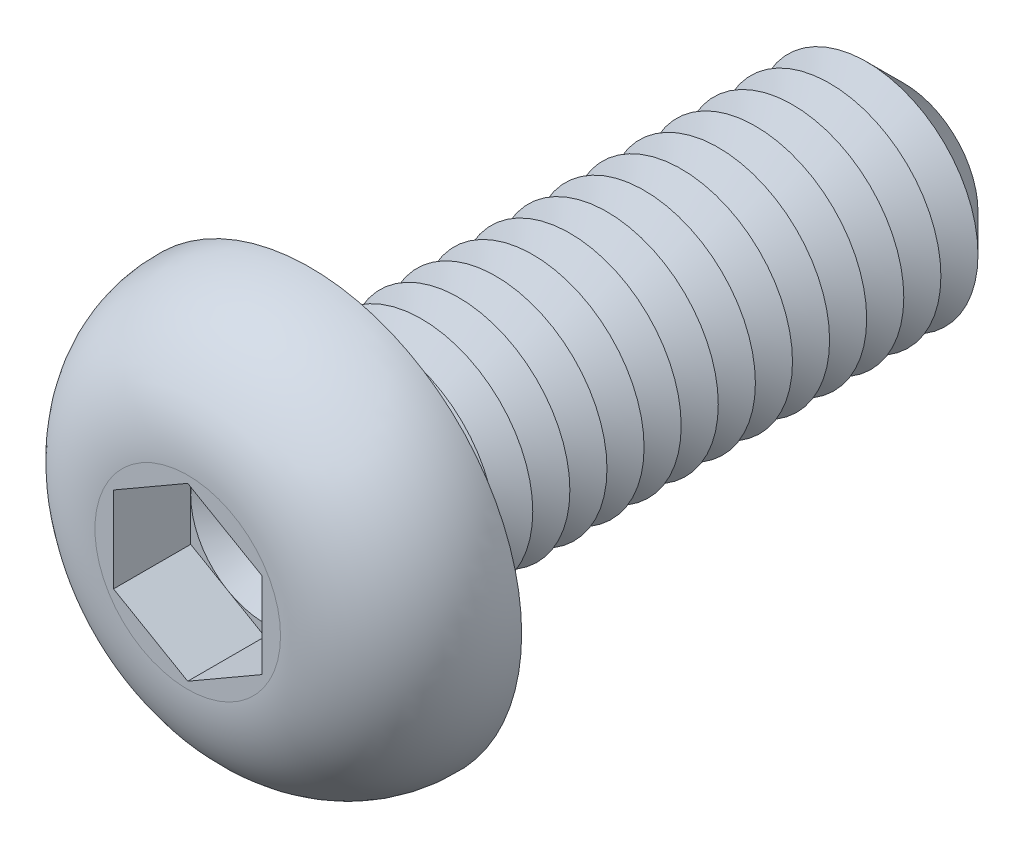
ISO-10303-21;
HEADER;
FILE_DESCRIPTION(('STEP AP214'),'2;1');
FILE_NAME('part.step','',(''),(''),'','','');
FILE_SCHEMA(('AUTOMOTIVE_DESIGN { 1 0 10303 214 1 1 1 1 }'));
ENDSEC;
DATA;
#1=APPLICATION_CONTEXT('core data for automotive mechanical design processes');
#2=APPLICATION_PROTOCOL_DEFINITION('international standard','automotive_design',2000,#1);
#3=PRODUCT_CONTEXT('',#1,'mechanical');
#4=PRODUCT('Part','Part','',(#3));
#5=PRODUCT_RELATED_PRODUCT_CATEGORY('part','',(#4));
#6=PRODUCT_DEFINITION_FORMATION('','',#4);
#7=PRODUCT_DEFINITION_CONTEXT('part definition',#1,'design');
#8=PRODUCT_DEFINITION('design','',#6,#7);
#9=PRODUCT_DEFINITION_SHAPE('','',#8);
#10=(LENGTH_UNIT() NAMED_UNIT(*) SI_UNIT(.MILLI.,.METRE.));
#11=(NAMED_UNIT(*) PLANE_ANGLE_UNIT() SI_UNIT($,.RADIAN.));
#12=(NAMED_UNIT(*) SI_UNIT($,.STERADIAN.) SOLID_ANGLE_UNIT());
#13=UNCERTAINTY_MEASURE_WITH_UNIT(LENGTH_MEASURE(1.E-05),#10,'distance_accuracy_value','');
#14=(GEOMETRIC_REPRESENTATION_CONTEXT(3) GLOBAL_UNCERTAINTY_ASSIGNED_CONTEXT((#13)) GLOBAL_UNIT_ASSIGNED_CONTEXT((#10,
#11,#12)) REPRESENTATION_CONTEXT('',''));
#15=CARTESIAN_POINT('',(0.,0.,0.));
#16=DIRECTION('',(0.,0.,1.));
#17=DIRECTION('',(1.,0.,0.));
#18=AXIS2_PLACEMENT_3D('',#15,#16,#17);
#19=CARTESIAN_POINT('',(0.,0.,0.61));
#20=DIRECTION('',(0.,0.,1.));
#21=DIRECTION('',(1.,0.,0.));
#22=AXIS2_PLACEMENT_3D('',#19,#20,#21);
#23=PLANE('',#22);
#24=CARTESIAN_POINT('',(0.,0.,0.61));
#25=DIRECTION('',(0.,0.,1.));
#26=DIRECTION('',(1.,0.,0.));
#27=AXIS2_PLACEMENT_3D('',#24,#25,#26);
#28=CIRCLE('',#27,1.);
#29=CARTESIAN_POINT('',(1.,0.,0.61));
#30=VERTEX_POINT('',#29);
#31=CARTESIAN_POINT('',(0.5,0.866025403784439,0.61));
#32=VERTEX_POINT('',#31);
#33=EDGE_CURVE('E111',#30,#32,#28,.T.);
#34=ORIENTED_EDGE('',*,*,#33,.F.);
#35=DIRECTION('',(0.,1.,0.));
#36=VECTOR('',#35,1.);
#37=CARTESIAN_POINT('',(1.,-0.577350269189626,0.61));
#38=LINE('',#37,#36);
#39=CARTESIAN_POINT('',(1.,0.577350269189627,0.61));
#40=VERTEX_POINT('',#39);
#41=EDGE_CURVE('E132',#30,#40,#38,.T.);
#42=ORIENTED_EDGE('',*,*,#41,.T.);
#43=DIRECTION('',(-0.866025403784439,0.5,0.));
#44=VECTOR('',#43,1.);
#45=CARTESIAN_POINT('',(1.,0.577350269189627,0.61));
#46=LINE('',#45,#44);
#47=EDGE_CURVE('E128',#40,#32,#46,.T.);
#48=ORIENTED_EDGE('',*,*,#47,.T.);
#49=EDGE_LOOP('',(#34,#42,#48));
#50=FACE_BOUND('',#49,.T.);
#51=ADVANCED_FACE('F34',(#50),#23,.T.);
#52=CARTESIAN_POINT('',(0.,0.,0.61));
#53=DIRECTION('',(0.,0.,1.));
#54=DIRECTION('',(1.,0.,0.));
#55=AXIS2_PLACEMENT_3D('',#52,#53,#54);
#56=CIRCLE('',#55,1.);
#57=CARTESIAN_POINT('',(-0.5,0.866025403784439,0.61));
#58=VERTEX_POINT('',#57);
#59=EDGE_CURVE('E11',#32,#58,#56,.T.);
#60=ORIENTED_EDGE('',*,*,#59,.F.);
#61=CARTESIAN_POINT('',(0.,1.15470053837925,0.61));
#62=VERTEX_POINT('',#61);
#63=EDGE_CURVE('E123',#32,#62,#46,.T.);
#64=ORIENTED_EDGE('',*,*,#63,.T.);
#65=DIRECTION('',(-0.866025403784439,-0.5,0.));
#66=VECTOR('',#65,1.);
#67=CARTESIAN_POINT('',(0.,1.15470053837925,0.61));
#68=LINE('',#67,#66);
#69=EDGE_CURVE('E125',#62,#58,#68,.T.);
#70=ORIENTED_EDGE('',*,*,#69,.T.);
#71=EDGE_LOOP('',(#60,#64,#70));
#72=FACE_BOUND('',#71,.T.);
#73=ADVANCED_FACE('F122',(#72),#23,.T.);
#74=CARTESIAN_POINT('',(-1.,0.,0.61));
#75=VERTEX_POINT('',#74);
#76=EDGE_CURVE('E43',#58,#75,#56,.T.);
#77=ORIENTED_EDGE('',*,*,#76,.F.);
#78=CARTESIAN_POINT('',(-1.,0.577350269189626,0.61));
#79=VERTEX_POINT('',#78);
#80=EDGE_CURVE('E134',#58,#79,#68,.T.);
#81=ORIENTED_EDGE('',*,*,#80,.T.);
#82=DIRECTION('',(0.,-1.,0.));
#83=VECTOR('',#82,1.);
#84=CARTESIAN_POINT('',(-1.,0.577350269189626,0.61));
#85=LINE('',#84,#83);
#86=EDGE_CURVE('E141',#79,#75,#85,.T.);
#87=ORIENTED_EDGE('',*,*,#86,.T.);
#88=EDGE_LOOP('',(#77,#81,#87));
#89=FACE_BOUND('',#88,.T.);
#90=ADVANCED_FACE('F208',(#89),#23,.T.);
#91=CARTESIAN_POINT('',(-0.5,-0.866025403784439,0.61));
#92=VERTEX_POINT('',#91);
#93=EDGE_CURVE('E196',#75,#92,#56,.T.);
#94=ORIENTED_EDGE('',*,*,#93,.F.);
#95=CARTESIAN_POINT('',(-1.,-0.577350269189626,0.61));
#96=VERTEX_POINT('',#95);
#97=EDGE_CURVE('E140',#75,#96,#85,.T.);
#98=ORIENTED_EDGE('',*,*,#97,.T.);
#99=DIRECTION('',(0.866025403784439,-0.5,0.));
#100=VECTOR('',#99,1.);
#101=CARTESIAN_POINT('',(-1.,-0.577350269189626,0.61));
#102=LINE('',#101,#100);
#103=EDGE_CURVE('E145',#96,#92,#102,.T.);
#104=ORIENTED_EDGE('',*,*,#103,.T.);
#105=EDGE_LOOP('',(#94,#98,#104));
#106=FACE_BOUND('',#105,.T.);
#107=ADVANCED_FACE('F202',(#106),#23,.T.);
#108=CARTESIAN_POINT('',(0.5,-0.866025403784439,0.61));
#109=VERTEX_POINT('',#108);
#110=EDGE_CURVE('E50',#92,#109,#56,.T.);
#111=ORIENTED_EDGE('',*,*,#110,.F.);
#112=CARTESIAN_POINT('',(0.,-1.15470053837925,0.61));
#113=VERTEX_POINT('',#112);
#114=EDGE_CURVE('E144',#92,#113,#102,.T.);
#115=ORIENTED_EDGE('',*,*,#114,.T.);
#116=DIRECTION('',(0.866025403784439,0.5,0.));
#117=VECTOR('',#116,1.);
#118=CARTESIAN_POINT('',(0.,-1.15470053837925,0.61));
#119=LINE('',#118,#117);
#120=EDGE_CURVE('E149',#113,#109,#119,.T.);
#121=ORIENTED_EDGE('',*,*,#120,.T.);
#122=EDGE_LOOP('',(#111,#115,#121));
#123=FACE_BOUND('',#122,.T.);
#124=ADVANCED_FACE('F226',(#123),#23,.T.);
#125=CARTESIAN_POINT('',(0.,0.,-8.));
#126=DIRECTION('',(0.,0.,1.));
#127=DIRECTION('',(1.,0.,0.));
#128=AXIS2_PLACEMENT_3D('',#125,#126,#127);
#129=CYLINDRICAL_SURFACE('',#128,1.5);
#130=CARTESIAN_POINT('',(0.,0.,-0.2));
#131=DIRECTION('',(0.,0.,1.));
#132=DIRECTION('',(1.,0.,0.));
#133=AXIS2_PLACEMENT_3D('',#130,#131,#132);
#134=CIRCLE('',#133,1.5);
#135=CARTESIAN_POINT('',(1.5,0.,-0.2));
#136=VERTEX_POINT('',#135);
#137=EDGE_CURVE('E190',#136,#136,#134,.F.);
#138=ORIENTED_EDGE('',*,*,#137,.T.);
#139=EDGE_LOOP('',(#138));
#140=FACE_BOUND('',#139,.T.);
#141=CARTESIAN_POINT('',(0.,0.,-0.5));
#142=DIRECTION('',(0.,0.,1.));
#143=DIRECTION('',(1.,0.,0.));
#144=AXIS2_PLACEMENT_3D('',#141,#142,#143);
#145=CIRCLE('',#144,1.50000000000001);
#146=CARTESIAN_POINT('',(1.50000000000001,0.,-0.5));
#147=VERTEX_POINT('',#146);
#148=EDGE_CURVE('E137',#147,#147,#145,.T.);
#149=ORIENTED_EDGE('',*,*,#148,.T.);
#150=EDGE_LOOP('',(#149));
#151=FACE_BOUND('',#150,.T.);
#152=ADVANCED_FACE('F262',(#140,#151),#129,.T.);
#153=CARTESIAN_POINT('',(0.,2.85,0.));
#154=DIRECTION('',(0.,0.,1.));
#155=DIRECTION('',(1.,0.,0.));
#156=AXIS2_PLACEMENT_3D('',#153,#154,#155);
#157=PLANE('',#156);
#158=CARTESIAN_POINT('',(0.,0.,0.));
#159=DIRECTION('',(0.,0.,1.));
#160=DIRECTION('',(1.,0.,0.));
#161=AXIS2_PLACEMENT_3D('',#158,#159,#160);
#162=CIRCLE('',#161,1.7);
#163=CARTESIAN_POINT('',(1.7,0.,0.));
#164=VERTEX_POINT('',#163);
#165=EDGE_CURVE('E192',#164,#164,#162,.T.);
#166=ORIENTED_EDGE('',*,*,#165,.T.);
#167=EDGE_LOOP('',(#166));
#168=FACE_BOUND('',#167,.T.);
#169=CARTESIAN_POINT('',(0.,0.,0.));
#170=DIRECTION('',(0.,0.,1.));
#171=DIRECTION('',(1.,0.,0.));
#172=AXIS2_PLACEMENT_3D('',#169,#170,#171);
#173=CIRCLE('',#172,2.85);
#174=CARTESIAN_POINT('',(2.85,0.,0.));
#175=VERTEX_POINT('',#174);
#176=EDGE_CURVE('E172',#175,#175,#173,.T.);
#177=ORIENTED_EDGE('',*,*,#176,.F.);
#178=EDGE_LOOP('',(#177));
#179=FACE_BOUND('',#178,.T.);
#180=ADVANCED_FACE('F267',(#168,#179),#157,.F.);
#181=CARTESIAN_POINT('',(0.,0.,1.65));
#182=DIRECTION('',(0.,0.,-1.));
#183=DIRECTION('',(-1.,0.,0.));
#184=AXIS2_PLACEMENT_3D('',#181,#182,#183);
#185=PLANE('',#184);
#186=DIRECTION('',(-0.866025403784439,-0.5,0.));
#187=VECTOR('',#186,1.);
#188=CARTESIAN_POINT('',(0.,1.15470053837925,1.65));
#189=LINE('',#188,#187);
#190=CARTESIAN_POINT('',(0.,1.15470053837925,1.65));
#191=VERTEX_POINT('',#190);
#192=CARTESIAN_POINT('',(-1.,0.577350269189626,1.65));
#193=VERTEX_POINT('',#192);
#194=EDGE_CURVE('E156',#191,#193,#189,.T.);
#195=ORIENTED_EDGE('',*,*,#194,.F.);
#196=DIRECTION('',(-0.866025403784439,0.5,0.));
#197=VECTOR('',#196,1.);
#198=CARTESIAN_POINT('',(1.,0.577350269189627,1.65));
#199=LINE('',#198,#197);
#200=CARTESIAN_POINT('',(1.,0.577350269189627,1.65));
#201=VERTEX_POINT('',#200);
#202=EDGE_CURVE('E58',#201,#191,#199,.T.);
#203=ORIENTED_EDGE('',*,*,#202,.F.);
#204=DIRECTION('',(0.,1.,0.));
#205=VECTOR('',#204,1.);
#206=CARTESIAN_POINT('',(1.,-0.577350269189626,1.65));
#207=LINE('',#206,#205);
#208=CARTESIAN_POINT('',(1.,-0.577350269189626,1.65));
#209=VERTEX_POINT('',#208);
#210=EDGE_CURVE('E130',#209,#201,#207,.T.);
#211=ORIENTED_EDGE('',*,*,#210,.F.);
#212=DIRECTION('',(0.866025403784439,0.5,0.));
#213=VECTOR('',#212,1.);
#214=CARTESIAN_POINT('',(0.,-1.15470053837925,1.65));
#215=LINE('',#214,#213);
#216=CARTESIAN_POINT('',(0.,-1.15470053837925,1.65));
#217=VERTEX_POINT('',#216);
#218=EDGE_CURVE('E165',#217,#209,#215,.T.);
#219=ORIENTED_EDGE('',*,*,#218,.F.);
#220=DIRECTION('',(0.866025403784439,-0.5,0.));
#221=VECTOR('',#220,1.);
#222=CARTESIAN_POINT('',(-1.,-0.577350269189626,1.65));
#223=LINE('',#222,#221);
#224=CARTESIAN_POINT('',(-1.,-0.577350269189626,1.65));
#225=VERTEX_POINT('',#224);
#226=EDGE_CURVE('E162',#225,#217,#223,.T.);
#227=ORIENTED_EDGE('',*,*,#226,.F.);
#228=DIRECTION('',(0.,-1.,0.));
#229=VECTOR('',#228,1.);
#230=CARTESIAN_POINT('',(-1.,0.577350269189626,1.65));
#231=LINE('',#230,#229);
#232=EDGE_CURVE('E159',#193,#225,#231,.T.);
#233=ORIENTED_EDGE('',*,*,#232,.F.);
#234=EDGE_LOOP('',(#195,#203,#211,#219,#227,#233));
#235=FACE_BOUND('',#234,.T.);
#236=CARTESIAN_POINT('',(0.,0.,1.65));
#237=DIRECTION('',(0.,0.,1.));
#238=DIRECTION('',(1.,0.,0.));
#239=AXIS2_PLACEMENT_3D('',#236,#237,#238);
#240=CIRCLE('',#239,1.25078144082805);
#241=CARTESIAN_POINT('',(1.25078144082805,0.,1.65));
#242=VERTEX_POINT('',#241);
#243=EDGE_CURVE('E184',#242,#242,#240,.T.);
#244=ORIENTED_EDGE('',*,*,#243,.T.);
#245=EDGE_LOOP('',(#244));
#246=FACE_BOUND('',#245,.T.);
#247=ADVANCED_FACE('F217',(#235,#246),#185,.F.);
#248=CARTESIAN_POINT('',(0.,0.,0.0499999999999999));
#249=DIRECTION('',(0.,0.,1.));
#250=DIRECTION('',(1.,0.,0.));
#251=AXIS2_PLACEMENT_3D('',#248,#249,#250);
#252=DEGENERATE_TOROIDAL_SURFACE('',#251,1.25078144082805,1.6,.T.);
#253=ORIENTED_EDGE('',*,*,#243,.F.);
#254=EDGE_LOOP('',(#253));
#255=FACE_BOUND('',#254,.T.);
#256=ORIENTED_EDGE('',*,*,#176,.T.);
#257=EDGE_LOOP('',(#256));
#258=FACE_BOUND('',#257,.T.);
#259=ADVANCED_FACE('F243',(#255,#258),#252,.T.);
#260=CARTESIAN_POINT('',(1.,0.577350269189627,0.61));
#261=DIRECTION('',(0.5,0.866025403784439,0.));
#262=DIRECTION('',(-0.866025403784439,0.5,0.));
#263=AXIS2_PLACEMENT_3D('',#260,#261,#262);
#264=PLANE('',#263);
#265=ORIENTED_EDGE('',*,*,#202,.T.);
#266=DIRECTION('',(0.,0.,1.));
#267=VECTOR('',#266,1.);
#268=CARTESIAN_POINT('',(0.,1.15470053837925,0.61));
#269=LINE('',#268,#267);
#270=EDGE_CURVE('E129',#62,#191,#269,.T.);
#271=ORIENTED_EDGE('',*,*,#270,.F.);
#272=ORIENTED_EDGE('',*,*,#63,.F.);
#273=ORIENTED_EDGE('',*,*,#47,.F.);
#274=DIRECTION('',(0.,0.,1.));
#275=VECTOR('',#274,1.);
#276=CARTESIAN_POINT('',(1.,0.577350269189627,0.61));
#277=LINE('',#276,#275);
#278=EDGE_CURVE('E170',#40,#201,#277,.T.);
#279=ORIENTED_EDGE('',*,*,#278,.T.);
#280=EDGE_LOOP('',(#265,#271,#272,#273,#279));
#281=FACE_BOUND('',#280,.T.);
#282=ADVANCED_FACE('F127',(#281),#264,.F.);
#283=CARTESIAN_POINT('',(1.,-0.577350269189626,0.61));
#284=DIRECTION('',(1.,0.,0.));
#285=DIRECTION('',(0.,0.,-1.));
#286=AXIS2_PLACEMENT_3D('',#283,#284,#285);
#287=PLANE('',#286);
#288=ORIENTED_EDGE('',*,*,#210,.T.);
#289=ORIENTED_EDGE('',*,*,#278,.F.);
#290=ORIENTED_EDGE('',*,*,#41,.F.);
#291=CARTESIAN_POINT('',(1.,-0.577350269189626,0.61));
#292=VERTEX_POINT('',#291);
#293=EDGE_CURVE('E152',#292,#30,#38,.T.);
#294=ORIENTED_EDGE('',*,*,#293,.F.);
#295=DIRECTION('',(0.,0.,1.));
#296=VECTOR('',#295,1.);
#297=CARTESIAN_POINT('',(1.,-0.577350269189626,0.61));
#298=LINE('',#297,#296);
#299=EDGE_CURVE('E173',#292,#209,#298,.T.);
#300=ORIENTED_EDGE('',*,*,#299,.T.);
#301=EDGE_LOOP('',(#288,#289,#290,#294,#300));
#302=FACE_BOUND('',#301,.T.);
#303=ADVANCED_FACE('F235',(#302),#287,.F.);
#304=CARTESIAN_POINT('',(0.,-1.15470053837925,0.61));
#305=DIRECTION('',(0.5,-0.866025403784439,0.));
#306=DIRECTION('',(0.866025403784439,0.5,0.));
#307=AXIS2_PLACEMENT_3D('',#304,#305,#306);
#308=PLANE('',#307);
#309=ORIENTED_EDGE('',*,*,#218,.T.);
#310=ORIENTED_EDGE('',*,*,#299,.F.);
#311=EDGE_CURVE('E148',#109,#292,#119,.T.);
#312=ORIENTED_EDGE('',*,*,#311,.F.);
#313=ORIENTED_EDGE('',*,*,#120,.F.);
#314=DIRECTION('',(0.,0.,1.));
#315=VECTOR('',#314,1.);
#316=CARTESIAN_POINT('',(0.,-1.15470053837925,0.61));
#317=LINE('',#316,#315);
#318=EDGE_CURVE('E175',#113,#217,#317,.T.);
#319=ORIENTED_EDGE('',*,*,#318,.T.);
#320=EDGE_LOOP('',(#309,#310,#312,#313,#319));
#321=FACE_BOUND('',#320,.T.);
#322=ADVANCED_FACE('F229',(#321),#308,.F.);
#323=CARTESIAN_POINT('',(-1.,-0.577350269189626,0.61));
#324=DIRECTION('',(-0.5,-0.866025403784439,0.));
#325=DIRECTION('',(0.866025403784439,-0.5,0.));
#326=AXIS2_PLACEMENT_3D('',#323,#324,#325);
#327=PLANE('',#326);
#328=ORIENTED_EDGE('',*,*,#226,.T.);
#329=ORIENTED_EDGE('',*,*,#318,.F.);
#330=ORIENTED_EDGE('',*,*,#114,.F.);
#331=ORIENTED_EDGE('',*,*,#103,.F.);
#332=DIRECTION('',(0.,0.,1.));
#333=VECTOR('',#332,1.);
#334=CARTESIAN_POINT('',(-1.,-0.577350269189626,0.61));
#335=LINE('',#334,#333);
#336=EDGE_CURVE('E177',#96,#225,#335,.T.);
#337=ORIENTED_EDGE('',*,*,#336,.T.);
#338=EDGE_LOOP('',(#328,#329,#330,#331,#337));
#339=FACE_BOUND('',#338,.T.);
#340=ADVANCED_FACE('F222',(#339),#327,.F.);
#341=CARTESIAN_POINT('',(-1.,0.577350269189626,0.61));
#342=DIRECTION('',(-1.,0.,0.));
#343=DIRECTION('',(0.,-1.,0.));
#344=AXIS2_PLACEMENT_3D('',#341,#342,#343);
#345=PLANE('',#344);
#346=ORIENTED_EDGE('',*,*,#232,.T.);
#347=ORIENTED_EDGE('',*,*,#336,.F.);
#348=ORIENTED_EDGE('',*,*,#97,.F.);
#349=ORIENTED_EDGE('',*,*,#86,.F.);
#350=DIRECTION('',(0.,0.,1.));
#351=VECTOR('',#350,1.);
#352=CARTESIAN_POINT('',(-1.,0.577350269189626,0.61));
#353=LINE('',#352,#351);
#354=EDGE_CURVE('E179',#79,#193,#353,.T.);
#355=ORIENTED_EDGE('',*,*,#354,.T.);
#356=EDGE_LOOP('',(#346,#347,#348,#349,#355));
#357=FACE_BOUND('',#356,.T.);
#358=ADVANCED_FACE('F207',(#357),#345,.F.);
#359=CARTESIAN_POINT('',(0.,1.15470053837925,0.61));
#360=DIRECTION('',(-0.5,0.866025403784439,0.));
#361=DIRECTION('',(-0.866025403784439,-0.5,0.));
#362=AXIS2_PLACEMENT_3D('',#359,#360,#361);
#363=PLANE('',#362);
#364=ORIENTED_EDGE('',*,*,#194,.T.);
#365=ORIENTED_EDGE('',*,*,#354,.F.);
#366=ORIENTED_EDGE('',*,*,#80,.F.);
#367=ORIENTED_EDGE('',*,*,#69,.F.);
#368=ORIENTED_EDGE('',*,*,#270,.T.);
#369=EDGE_LOOP('',(#364,#365,#366,#367,#368));
#370=FACE_BOUND('',#369,.T.);
#371=ADVANCED_FACE('F211',(#370),#363,.F.);
#372=EDGE_CURVE('E38',#109,#30,#56,.T.);
#373=ORIENTED_EDGE('',*,*,#372,.F.);
#374=ORIENTED_EDGE('',*,*,#311,.T.);
#375=ORIENTED_EDGE('',*,*,#293,.T.);
#376=EDGE_LOOP('',(#373,#374,#375));
#377=FACE_BOUND('',#376,.T.);
#378=ADVANCED_FACE('F233',(#377),#23,.T.);
#379=CARTESIAN_POINT('',(0.,0.,-0.5));
#380=DIRECTION('',(0.,0.,1.));
#381=DIRECTION('',(1.,0.,0.));
#382=AXIS2_PLACEMENT_3D('',#379,#380,#381);
#383=CONICAL_SURFACE('',#382,1.50000000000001,1.0471975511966);
#384=CARTESIAN_POINT('',(0.,0.,-0.750000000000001));
#385=DIRECTION('',(0.,0.,1.));
#386=DIRECTION('',(1.,0.,0.));
#387=AXIS2_PLACEMENT_3D('',#384,#385,#386);
#388=CIRCLE('',#387,1.06698729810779);
#389=CARTESIAN_POINT('',(1.06698729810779,0.,-0.750000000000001));
#390=VERTEX_POINT('',#389);
#391=EDGE_CURVE('E764',#390,#390,#388,.T.);
#392=ORIENTED_EDGE('',*,*,#391,.T.);
#393=EDGE_LOOP('',(#392));
#394=FACE_BOUND('',#393,.T.);
#395=ORIENTED_EDGE('',*,*,#148,.F.);
#396=EDGE_LOOP('',(#395));
#397=FACE_BOUND('',#396,.T.);
#398=ADVANCED_FACE('F252',(#394,#397),#383,.T.);
#399=CARTESIAN_POINT('',(0.,0.,-0.750000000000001));
#400=DIRECTION('',(0.,0.,-1.));
#401=DIRECTION('',(-1.,0.,0.));
#402=AXIS2_PLACEMENT_3D('',#399,#400,#401);
#403=CONICAL_SURFACE('',#402,1.06698729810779,1.0471975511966);
#404=CARTESIAN_POINT('',(0.,0.,-1.));
#405=DIRECTION('',(0.,0.,1.));
#406=DIRECTION('',(1.,0.,0.));
#407=AXIS2_PLACEMENT_3D('',#404,#405,#406);
#408=CIRCLE('',#407,1.50000000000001);
#409=CARTESIAN_POINT('',(1.50000000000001,0.,-1.));
#410=VERTEX_POINT('',#409);
#411=EDGE_CURVE('E762',#410,#410,#408,.T.);
#412=ORIENTED_EDGE('',*,*,#411,.T.);
#413=EDGE_LOOP('',(#412));
#414=FACE_BOUND('',#413,.T.);
#415=ORIENTED_EDGE('',*,*,#391,.F.);
#416=EDGE_LOOP('',(#415));
#417=FACE_BOUND('',#416,.T.);
#418=ADVANCED_FACE('F257',(#414,#417),#403,.T.);
#419=CARTESIAN_POINT('',(0.,0.,-1.));
#420=DIRECTION('',(0.,0.,1.));
#421=DIRECTION('',(1.,0.,0.));
#422=AXIS2_PLACEMENT_3D('',#419,#420,#421);
#423=CONICAL_SURFACE('',#422,1.50000000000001,1.0471975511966);
#424=CARTESIAN_POINT('',(0.,0.,-1.25));
#425=DIRECTION('',(0.,0.,1.));
#426=DIRECTION('',(1.,0.,0.));
#427=AXIS2_PLACEMENT_3D('',#424,#425,#426);
#428=CIRCLE('',#427,1.06698729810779);
#429=CARTESIAN_POINT('',(1.06698729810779,0.,-1.25));
#430=VERTEX_POINT('',#429);
#431=EDGE_CURVE('E759',#430,#430,#428,.T.);
#432=ORIENTED_EDGE('',*,*,#431,.T.);
#433=EDGE_LOOP('',(#432));
#434=FACE_BOUND('',#433,.T.);
#435=ORIENTED_EDGE('',*,*,#411,.F.);
#436=EDGE_LOOP('',(#435));
#437=FACE_BOUND('',#436,.T.);
#438=ADVANCED_FACE('F564',(#434,#437),#423,.T.);
#439=CARTESIAN_POINT('',(0.,0.,-1.25));
#440=DIRECTION('',(0.,0.,-1.));
#441=DIRECTION('',(-1.,0.,0.));
#442=AXIS2_PLACEMENT_3D('',#439,#440,#441);
#443=CONICAL_SURFACE('',#442,1.06698729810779,1.0471975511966);
#444=CARTESIAN_POINT('',(0.,0.,-1.5));
#445=DIRECTION('',(0.,0.,1.));
#446=DIRECTION('',(1.,0.,0.));
#447=AXIS2_PLACEMENT_3D('',#444,#445,#446);
#448=CIRCLE('',#447,1.50000000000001);
#449=CARTESIAN_POINT('',(1.50000000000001,0.,-1.5));
#450=VERTEX_POINT('',#449);
#451=EDGE_CURVE('E756',#450,#450,#448,.T.);
#452=ORIENTED_EDGE('',*,*,#451,.T.);
#453=EDGE_LOOP('',(#452));
#454=FACE_BOUND('',#453,.T.);
#455=ORIENTED_EDGE('',*,*,#431,.F.);
#456=EDGE_LOOP('',(#455));
#457=FACE_BOUND('',#456,.T.);
#458=ADVANCED_FACE('F554',(#454,#457),#443,.T.);
#459=CARTESIAN_POINT('',(0.,0.,-1.5));
#460=DIRECTION('',(0.,0.,1.));
#461=DIRECTION('',(1.,0.,0.));
#462=AXIS2_PLACEMENT_3D('',#459,#460,#461);
#463=CONICAL_SURFACE('',#462,1.50000000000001,1.0471975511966);
#464=CARTESIAN_POINT('',(0.,0.,-1.75));
#465=DIRECTION('',(0.,0.,1.));
#466=DIRECTION('',(1.,0.,0.));
#467=AXIS2_PLACEMENT_3D('',#464,#465,#466);
#468=CIRCLE('',#467,1.06698729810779);
#469=CARTESIAN_POINT('',(1.06698729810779,0.,-1.75));
#470=VERTEX_POINT('',#469);
#471=EDGE_CURVE('E753',#470,#470,#468,.T.);
#472=ORIENTED_EDGE('',*,*,#471,.T.);
#473=EDGE_LOOP('',(#472));
#474=FACE_BOUND('',#473,.T.);
#475=ORIENTED_EDGE('',*,*,#451,.F.);
#476=EDGE_LOOP('',(#475));
#477=FACE_BOUND('',#476,.T.);
#478=ADVANCED_FACE('F544',(#474,#477),#463,.T.);
#479=CARTESIAN_POINT('',(0.,0.,-1.75));
#480=DIRECTION('',(0.,0.,-1.));
#481=DIRECTION('',(-1.,0.,0.));
#482=AXIS2_PLACEMENT_3D('',#479,#480,#481);
#483=CONICAL_SURFACE('',#482,1.06698729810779,1.0471975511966);
#484=CARTESIAN_POINT('',(0.,0.,-2.));
#485=DIRECTION('',(0.,0.,1.));
#486=DIRECTION('',(1.,0.,0.));
#487=AXIS2_PLACEMENT_3D('',#484,#485,#486);
#488=CIRCLE('',#487,1.50000000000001);
#489=CARTESIAN_POINT('',(1.50000000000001,0.,-2.));
#490=VERTEX_POINT('',#489);
#491=EDGE_CURVE('E750',#490,#490,#488,.T.);
#492=ORIENTED_EDGE('',*,*,#491,.T.);
#493=EDGE_LOOP('',(#492));
#494=FACE_BOUND('',#493,.T.);
#495=ORIENTED_EDGE('',*,*,#471,.F.);
#496=EDGE_LOOP('',(#495));
#497=FACE_BOUND('',#496,.T.);
#498=ADVANCED_FACE('F534',(#494,#497),#483,.T.);
#499=CARTESIAN_POINT('',(0.,0.,-2.));
#500=DIRECTION('',(0.,0.,1.));
#501=DIRECTION('',(1.,0.,0.));
#502=AXIS2_PLACEMENT_3D('',#499,#500,#501);
#503=CONICAL_SURFACE('',#502,1.50000000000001,1.0471975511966);
#504=CARTESIAN_POINT('',(0.,0.,-2.25));
#505=DIRECTION('',(0.,0.,1.));
#506=DIRECTION('',(1.,0.,0.));
#507=AXIS2_PLACEMENT_3D('',#504,#505,#506);
#508=CIRCLE('',#507,1.06698729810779);
#509=CARTESIAN_POINT('',(1.06698729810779,0.,-2.25));
#510=VERTEX_POINT('',#509);
#511=EDGE_CURVE('E747',#510,#510,#508,.T.);
#512=ORIENTED_EDGE('',*,*,#511,.T.);
#513=EDGE_LOOP('',(#512));
#514=FACE_BOUND('',#513,.T.);
#515=ORIENTED_EDGE('',*,*,#491,.F.);
#516=EDGE_LOOP('',(#515));
#517=FACE_BOUND('',#516,.T.);
#518=ADVANCED_FACE('F524',(#514,#517),#503,.T.);
#519=CARTESIAN_POINT('',(0.,0.,-2.25));
#520=DIRECTION('',(0.,0.,-1.));
#521=DIRECTION('',(-1.,0.,0.));
#522=AXIS2_PLACEMENT_3D('',#519,#520,#521);
#523=CONICAL_SURFACE('',#522,1.06698729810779,1.0471975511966);
#524=CARTESIAN_POINT('',(0.,0.,-2.5));
#525=DIRECTION('',(0.,0.,1.));
#526=DIRECTION('',(1.,0.,0.));
#527=AXIS2_PLACEMENT_3D('',#524,#525,#526);
#528=CIRCLE('',#527,1.50000000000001);
#529=CARTESIAN_POINT('',(1.50000000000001,0.,-2.5));
#530=VERTEX_POINT('',#529);
#531=EDGE_CURVE('E744',#530,#530,#528,.T.);
#532=ORIENTED_EDGE('',*,*,#531,.T.);
#533=EDGE_LOOP('',(#532));
#534=FACE_BOUND('',#533,.T.);
#535=ORIENTED_EDGE('',*,*,#511,.F.);
#536=EDGE_LOOP('',(#535));
#537=FACE_BOUND('',#536,.T.);
#538=ADVANCED_FACE('F514',(#534,#537),#523,.T.);
#539=CARTESIAN_POINT('',(0.,0.,-2.5));
#540=DIRECTION('',(0.,0.,1.));
#541=DIRECTION('',(1.,0.,0.));
#542=AXIS2_PLACEMENT_3D('',#539,#540,#541);
#543=CONICAL_SURFACE('',#542,1.50000000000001,1.0471975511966);
#544=CARTESIAN_POINT('',(0.,0.,-2.75));
#545=DIRECTION('',(0.,0.,1.));
#546=DIRECTION('',(1.,0.,0.));
#547=AXIS2_PLACEMENT_3D('',#544,#545,#546);
#548=CIRCLE('',#547,1.06698729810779);
#549=CARTESIAN_POINT('',(1.06698729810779,0.,-2.75));
#550=VERTEX_POINT('',#549);
#551=EDGE_CURVE('E741',#550,#550,#548,.T.);
#552=ORIENTED_EDGE('',*,*,#551,.T.);
#553=EDGE_LOOP('',(#552));
#554=FACE_BOUND('',#553,.T.);
#555=ORIENTED_EDGE('',*,*,#531,.F.);
#556=EDGE_LOOP('',(#555));
#557=FACE_BOUND('',#556,.T.);
#558=ADVANCED_FACE('F504',(#554,#557),#543,.T.);
#559=CARTESIAN_POINT('',(0.,0.,-2.75));
#560=DIRECTION('',(0.,0.,-1.));
#561=DIRECTION('',(-1.,0.,0.));
#562=AXIS2_PLACEMENT_3D('',#559,#560,#561);
#563=CONICAL_SURFACE('',#562,1.06698729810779,1.0471975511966);
#564=CARTESIAN_POINT('',(0.,0.,-3.));
#565=DIRECTION('',(0.,0.,1.));
#566=DIRECTION('',(1.,0.,0.));
#567=AXIS2_PLACEMENT_3D('',#564,#565,#566);
#568=CIRCLE('',#567,1.50000000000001);
#569=CARTESIAN_POINT('',(1.50000000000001,0.,-3.));
#570=VERTEX_POINT('',#569);
#571=EDGE_CURVE('E738',#570,#570,#568,.T.);
#572=ORIENTED_EDGE('',*,*,#571,.T.);
#573=EDGE_LOOP('',(#572));
#574=FACE_BOUND('',#573,.T.);
#575=ORIENTED_EDGE('',*,*,#551,.F.);
#576=EDGE_LOOP('',(#575));
#577=FACE_BOUND('',#576,.T.);
#578=ADVANCED_FACE('F494',(#574,#577),#563,.T.);
#579=CARTESIAN_POINT('',(0.,0.,-3.));
#580=DIRECTION('',(0.,0.,1.));
#581=DIRECTION('',(1.,0.,0.));
#582=AXIS2_PLACEMENT_3D('',#579,#580,#581);
#583=CONICAL_SURFACE('',#582,1.50000000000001,1.0471975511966);
#584=CARTESIAN_POINT('',(0.,0.,-3.25));
#585=DIRECTION('',(0.,0.,1.));
#586=DIRECTION('',(1.,0.,0.));
#587=AXIS2_PLACEMENT_3D('',#584,#585,#586);
#588=CIRCLE('',#587,1.06698729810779);
#589=CARTESIAN_POINT('',(1.06698729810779,0.,-3.25));
#590=VERTEX_POINT('',#589);
#591=EDGE_CURVE('E735',#590,#590,#588,.T.);
#592=ORIENTED_EDGE('',*,*,#591,.T.);
#593=EDGE_LOOP('',(#592));
#594=FACE_BOUND('',#593,.T.);
#595=ORIENTED_EDGE('',*,*,#571,.F.);
#596=EDGE_LOOP('',(#595));
#597=FACE_BOUND('',#596,.T.);
#598=ADVANCED_FACE('F484',(#594,#597),#583,.T.);
#599=CARTESIAN_POINT('',(0.,0.,-3.25));
#600=DIRECTION('',(0.,0.,-1.));
#601=DIRECTION('',(-1.,0.,0.));
#602=AXIS2_PLACEMENT_3D('',#599,#600,#601);
#603=CONICAL_SURFACE('',#602,1.06698729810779,1.0471975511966);
#604=CARTESIAN_POINT('',(0.,0.,-3.5));
#605=DIRECTION('',(0.,0.,1.));
#606=DIRECTION('',(1.,0.,0.));
#607=AXIS2_PLACEMENT_3D('',#604,#605,#606);
#608=CIRCLE('',#607,1.50000000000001);
#609=CARTESIAN_POINT('',(1.50000000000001,0.,-3.5));
#610=VERTEX_POINT('',#609);
#611=EDGE_CURVE('E732',#610,#610,#608,.T.);
#612=ORIENTED_EDGE('',*,*,#611,.T.);
#613=EDGE_LOOP('',(#612));
#614=FACE_BOUND('',#613,.T.);
#615=ORIENTED_EDGE('',*,*,#591,.F.);
#616=EDGE_LOOP('',(#615));
#617=FACE_BOUND('',#616,.T.);
#618=ADVANCED_FACE('F474',(#614,#617),#603,.T.);
#619=CARTESIAN_POINT('',(0.,0.,-3.5));
#620=DIRECTION('',(0.,0.,1.));
#621=DIRECTION('',(1.,0.,0.));
#622=AXIS2_PLACEMENT_3D('',#619,#620,#621);
#623=CONICAL_SURFACE('',#622,1.50000000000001,1.0471975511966);
#624=CARTESIAN_POINT('',(0.,0.,-3.75));
#625=DIRECTION('',(0.,0.,1.));
#626=DIRECTION('',(1.,0.,0.));
#627=AXIS2_PLACEMENT_3D('',#624,#625,#626);
#628=CIRCLE('',#627,1.06698729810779);
#629=CARTESIAN_POINT('',(1.06698729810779,0.,-3.75));
#630=VERTEX_POINT('',#629);
#631=EDGE_CURVE('E729',#630,#630,#628,.T.);
#632=ORIENTED_EDGE('',*,*,#631,.T.);
#633=EDGE_LOOP('',(#632));
#634=FACE_BOUND('',#633,.T.);
#635=ORIENTED_EDGE('',*,*,#611,.F.);
#636=EDGE_LOOP('',(#635));
#637=FACE_BOUND('',#636,.T.);
#638=ADVANCED_FACE('F464',(#634,#637),#623,.T.);
#639=CARTESIAN_POINT('',(0.,0.,-3.75));
#640=DIRECTION('',(0.,0.,-1.));
#641=DIRECTION('',(-1.,0.,0.));
#642=AXIS2_PLACEMENT_3D('',#639,#640,#641);
#643=CONICAL_SURFACE('',#642,1.06698729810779,1.0471975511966);
#644=CARTESIAN_POINT('',(0.,0.,-4.));
#645=DIRECTION('',(0.,0.,1.));
#646=DIRECTION('',(1.,0.,0.));
#647=AXIS2_PLACEMENT_3D('',#644,#645,#646);
#648=CIRCLE('',#647,1.50000000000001);
#649=CARTESIAN_POINT('',(1.50000000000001,0.,-4.));
#650=VERTEX_POINT('',#649);
#651=EDGE_CURVE('E726',#650,#650,#648,.T.);
#652=ORIENTED_EDGE('',*,*,#651,.T.);
#653=EDGE_LOOP('',(#652));
#654=FACE_BOUND('',#653,.T.);
#655=ORIENTED_EDGE('',*,*,#631,.F.);
#656=EDGE_LOOP('',(#655));
#657=FACE_BOUND('',#656,.T.);
#658=ADVANCED_FACE('F454',(#654,#657),#643,.T.);
#659=CARTESIAN_POINT('',(0.,0.,-4.));
#660=DIRECTION('',(0.,0.,1.));
#661=DIRECTION('',(1.,0.,0.));
#662=AXIS2_PLACEMENT_3D('',#659,#660,#661);
#663=CONICAL_SURFACE('',#662,1.50000000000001,1.0471975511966);
#664=CARTESIAN_POINT('',(0.,0.,-4.25));
#665=DIRECTION('',(0.,0.,1.));
#666=DIRECTION('',(1.,0.,0.));
#667=AXIS2_PLACEMENT_3D('',#664,#665,#666);
#668=CIRCLE('',#667,1.06698729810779);
#669=CARTESIAN_POINT('',(1.06698729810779,0.,-4.25));
#670=VERTEX_POINT('',#669);
#671=EDGE_CURVE('E723',#670,#670,#668,.T.);
#672=ORIENTED_EDGE('',*,*,#671,.T.);
#673=EDGE_LOOP('',(#672));
#674=FACE_BOUND('',#673,.T.);
#675=ORIENTED_EDGE('',*,*,#651,.F.);
#676=EDGE_LOOP('',(#675));
#677=FACE_BOUND('',#676,.T.);
#678=ADVANCED_FACE('F444',(#674,#677),#663,.T.);
#679=CARTESIAN_POINT('',(0.,0.,-4.25));
#680=DIRECTION('',(0.,0.,-1.));
#681=DIRECTION('',(-1.,0.,0.));
#682=AXIS2_PLACEMENT_3D('',#679,#680,#681);
#683=CONICAL_SURFACE('',#682,1.06698729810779,1.0471975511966);
#684=CARTESIAN_POINT('',(0.,0.,-4.5));
#685=DIRECTION('',(0.,0.,1.));
#686=DIRECTION('',(1.,0.,0.));
#687=AXIS2_PLACEMENT_3D('',#684,#685,#686);
#688=CIRCLE('',#687,1.50000000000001);
#689=CARTESIAN_POINT('',(1.50000000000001,0.,-4.5));
#690=VERTEX_POINT('',#689);
#691=EDGE_CURVE('E720',#690,#690,#688,.T.);
#692=ORIENTED_EDGE('',*,*,#691,.T.);
#693=EDGE_LOOP('',(#692));
#694=FACE_BOUND('',#693,.T.);
#695=ORIENTED_EDGE('',*,*,#671,.F.);
#696=EDGE_LOOP('',(#695));
#697=FACE_BOUND('',#696,.T.);
#698=ADVANCED_FACE('F434',(#694,#697),#683,.T.);
#699=CARTESIAN_POINT('',(0.,0.,-4.5));
#700=DIRECTION('',(0.,0.,1.));
#701=DIRECTION('',(1.,0.,0.));
#702=AXIS2_PLACEMENT_3D('',#699,#700,#701);
#703=CONICAL_SURFACE('',#702,1.50000000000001,1.0471975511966);
#704=CARTESIAN_POINT('',(0.,0.,-4.75));
#705=DIRECTION('',(0.,0.,1.));
#706=DIRECTION('',(1.,0.,0.));
#707=AXIS2_PLACEMENT_3D('',#704,#705,#706);
#708=CIRCLE('',#707,1.06698729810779);
#709=CARTESIAN_POINT('',(1.06698729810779,0.,-4.75));
#710=VERTEX_POINT('',#709);
#711=EDGE_CURVE('E717',#710,#710,#708,.T.);
#712=ORIENTED_EDGE('',*,*,#711,.T.);
#713=EDGE_LOOP('',(#712));
#714=FACE_BOUND('',#713,.T.);
#715=ORIENTED_EDGE('',*,*,#691,.F.);
#716=EDGE_LOOP('',(#715));
#717=FACE_BOUND('',#716,.T.);
#718=ADVANCED_FACE('F424',(#714,#717),#703,.T.);
#719=CARTESIAN_POINT('',(0.,0.,-4.75));
#720=DIRECTION('',(0.,0.,-1.));
#721=DIRECTION('',(-1.,0.,0.));
#722=AXIS2_PLACEMENT_3D('',#719,#720,#721);
#723=CONICAL_SURFACE('',#722,1.06698729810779,1.0471975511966);
#724=CARTESIAN_POINT('',(0.,0.,-5.));
#725=DIRECTION('',(0.,0.,1.));
#726=DIRECTION('',(1.,0.,0.));
#727=AXIS2_PLACEMENT_3D('',#724,#725,#726);
#728=CIRCLE('',#727,1.50000000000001);
#729=CARTESIAN_POINT('',(1.50000000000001,0.,-5.));
#730=VERTEX_POINT('',#729);
#731=EDGE_CURVE('E714',#730,#730,#728,.T.);
#732=ORIENTED_EDGE('',*,*,#731,.T.);
#733=EDGE_LOOP('',(#732));
#734=FACE_BOUND('',#733,.T.);
#735=ORIENTED_EDGE('',*,*,#711,.F.);
#736=EDGE_LOOP('',(#735));
#737=FACE_BOUND('',#736,.T.);
#738=ADVANCED_FACE('F414',(#734,#737),#723,.T.);
#739=CARTESIAN_POINT('',(0.,0.,-5.));
#740=DIRECTION('',(0.,0.,1.));
#741=DIRECTION('',(1.,0.,0.));
#742=AXIS2_PLACEMENT_3D('',#739,#740,#741);
#743=CONICAL_SURFACE('',#742,1.50000000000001,1.0471975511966);
#744=CARTESIAN_POINT('',(0.,0.,-5.25));
#745=DIRECTION('',(0.,0.,1.));
#746=DIRECTION('',(1.,0.,0.));
#747=AXIS2_PLACEMENT_3D('',#744,#745,#746);
#748=CIRCLE('',#747,1.06698729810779);
#749=CARTESIAN_POINT('',(1.06698729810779,0.,-5.25));
#750=VERTEX_POINT('',#749);
#751=EDGE_CURVE('E711',#750,#750,#748,.T.);
#752=ORIENTED_EDGE('',*,*,#751,.T.);
#753=EDGE_LOOP('',(#752));
#754=FACE_BOUND('',#753,.T.);
#755=ORIENTED_EDGE('',*,*,#731,.F.);
#756=EDGE_LOOP('',(#755));
#757=FACE_BOUND('',#756,.T.);
#758=ADVANCED_FACE('F404',(#754,#757),#743,.T.);
#759=CARTESIAN_POINT('',(0.,0.,-5.25));
#760=DIRECTION('',(0.,0.,-1.));
#761=DIRECTION('',(-1.,0.,0.));
#762=AXIS2_PLACEMENT_3D('',#759,#760,#761);
#763=CONICAL_SURFACE('',#762,1.06698729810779,1.0471975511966);
#764=CARTESIAN_POINT('',(0.,0.,-5.5));
#765=DIRECTION('',(0.,0.,1.));
#766=DIRECTION('',(1.,0.,0.));
#767=AXIS2_PLACEMENT_3D('',#764,#765,#766);
#768=CIRCLE('',#767,1.50000000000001);
#769=CARTESIAN_POINT('',(1.50000000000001,0.,-5.5));
#770=VERTEX_POINT('',#769);
#771=EDGE_CURVE('E708',#770,#770,#768,.T.);
#772=ORIENTED_EDGE('',*,*,#771,.T.);
#773=EDGE_LOOP('',(#772));
#774=FACE_BOUND('',#773,.T.);
#775=ORIENTED_EDGE('',*,*,#751,.F.);
#776=EDGE_LOOP('',(#775));
#777=FACE_BOUND('',#776,.T.);
#778=ADVANCED_FACE('F394',(#774,#777),#763,.T.);
#779=CARTESIAN_POINT('',(0.,0.,-5.5));
#780=DIRECTION('',(0.,0.,1.));
#781=DIRECTION('',(1.,0.,0.));
#782=AXIS2_PLACEMENT_3D('',#779,#780,#781);
#783=CONICAL_SURFACE('',#782,1.50000000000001,1.0471975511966);
#784=CARTESIAN_POINT('',(0.,0.,-5.75));
#785=DIRECTION('',(0.,0.,1.));
#786=DIRECTION('',(1.,0.,0.));
#787=AXIS2_PLACEMENT_3D('',#784,#785,#786);
#788=CIRCLE('',#787,1.06698729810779);
#789=CARTESIAN_POINT('',(1.06698729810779,0.,-5.75));
#790=VERTEX_POINT('',#789);
#791=EDGE_CURVE('E705',#790,#790,#788,.T.);
#792=ORIENTED_EDGE('',*,*,#791,.T.);
#793=EDGE_LOOP('',(#792));
#794=FACE_BOUND('',#793,.T.);
#795=ORIENTED_EDGE('',*,*,#771,.F.);
#796=EDGE_LOOP('',(#795));
#797=FACE_BOUND('',#796,.T.);
#798=ADVANCED_FACE('F384',(#794,#797),#783,.T.);
#799=CARTESIAN_POINT('',(0.,0.,-5.75));
#800=DIRECTION('',(0.,0.,-1.));
#801=DIRECTION('',(-1.,0.,0.));
#802=AXIS2_PLACEMENT_3D('',#799,#800,#801);
#803=CONICAL_SURFACE('',#802,1.06698729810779,1.0471975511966);
#804=CARTESIAN_POINT('',(0.,0.,-6.));
#805=DIRECTION('',(0.,0.,1.));
#806=DIRECTION('',(1.,0.,0.));
#807=AXIS2_PLACEMENT_3D('',#804,#805,#806);
#808=CIRCLE('',#807,1.50000000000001);
#809=CARTESIAN_POINT('',(1.50000000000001,0.,-6.));
#810=VERTEX_POINT('',#809);
#811=EDGE_CURVE('E702',#810,#810,#808,.T.);
#812=ORIENTED_EDGE('',*,*,#811,.T.);
#813=EDGE_LOOP('',(#812));
#814=FACE_BOUND('',#813,.T.);
#815=ORIENTED_EDGE('',*,*,#791,.F.);
#816=EDGE_LOOP('',(#815));
#817=FACE_BOUND('',#816,.T.);
#818=ADVANCED_FACE('F374',(#814,#817),#803,.T.);
#819=CARTESIAN_POINT('',(0.,0.,-6.));
#820=DIRECTION('',(0.,0.,1.));
#821=DIRECTION('',(1.,0.,0.));
#822=AXIS2_PLACEMENT_3D('',#819,#820,#821);
#823=CONICAL_SURFACE('',#822,1.50000000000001,1.0471975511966);
#824=CARTESIAN_POINT('',(0.,0.,-6.25));
#825=DIRECTION('',(0.,0.,1.));
#826=DIRECTION('',(1.,0.,0.));
#827=AXIS2_PLACEMENT_3D('',#824,#825,#826);
#828=CIRCLE('',#827,1.06698729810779);
#829=CARTESIAN_POINT('',(1.06698729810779,0.,-6.25));
#830=VERTEX_POINT('',#829);
#831=EDGE_CURVE('E699',#830,#830,#828,.T.);
#832=ORIENTED_EDGE('',*,*,#831,.T.);
#833=EDGE_LOOP('',(#832));
#834=FACE_BOUND('',#833,.T.);
#835=ORIENTED_EDGE('',*,*,#811,.F.);
#836=EDGE_LOOP('',(#835));
#837=FACE_BOUND('',#836,.T.);
#838=ADVANCED_FACE('F364',(#834,#837),#823,.T.);
#839=CARTESIAN_POINT('',(0.,0.,-6.25));
#840=DIRECTION('',(0.,0.,-1.));
#841=DIRECTION('',(-1.,0.,0.));
#842=AXIS2_PLACEMENT_3D('',#839,#840,#841);
#843=CONICAL_SURFACE('',#842,1.06698729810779,1.0471975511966);
#844=CARTESIAN_POINT('',(0.,0.,-6.5));
#845=DIRECTION('',(0.,0.,1.));
#846=DIRECTION('',(1.,0.,0.));
#847=AXIS2_PLACEMENT_3D('',#844,#845,#846);
#848=CIRCLE('',#847,1.50000000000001);
#849=CARTESIAN_POINT('',(1.50000000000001,0.,-6.5));
#850=VERTEX_POINT('',#849);
#851=EDGE_CURVE('E696',#850,#850,#848,.T.);
#852=ORIENTED_EDGE('',*,*,#851,.T.);
#853=EDGE_LOOP('',(#852));
#854=FACE_BOUND('',#853,.T.);
#855=ORIENTED_EDGE('',*,*,#831,.F.);
#856=EDGE_LOOP('',(#855));
#857=FACE_BOUND('',#856,.T.);
#858=ADVANCED_FACE('F354',(#854,#857),#843,.T.);
#859=CARTESIAN_POINT('',(0.,0.,-6.5));
#860=DIRECTION('',(0.,0.,1.));
#861=DIRECTION('',(1.,0.,0.));
#862=AXIS2_PLACEMENT_3D('',#859,#860,#861);
#863=CONICAL_SURFACE('',#862,1.50000000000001,1.0471975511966);
#864=CARTESIAN_POINT('',(0.,0.,-6.75));
#865=DIRECTION('',(0.,0.,1.));
#866=DIRECTION('',(1.,0.,0.));
#867=AXIS2_PLACEMENT_3D('',#864,#865,#866);
#868=CIRCLE('',#867,1.06698729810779);
#869=CARTESIAN_POINT('',(1.06698729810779,0.,-6.75));
#870=VERTEX_POINT('',#869);
#871=EDGE_CURVE('E689',#870,#870,#868,.T.);
#872=ORIENTED_EDGE('',*,*,#871,.T.);
#873=EDGE_LOOP('',(#872));
#874=FACE_BOUND('',#873,.T.);
#875=ORIENTED_EDGE('',*,*,#851,.F.);
#876=EDGE_LOOP('',(#875));
#877=FACE_BOUND('',#876,.T.);
#878=ADVANCED_FACE('F344',(#874,#877),#863,.T.);
#879=CARTESIAN_POINT('',(0.,0.,-6.75));
#880=DIRECTION('',(0.,0.,-1.));
#881=DIRECTION('',(-1.,0.,0.));
#882=AXIS2_PLACEMENT_3D('',#879,#880,#881);
#883=CONICAL_SURFACE('',#882,1.06698729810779,1.0471975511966);
#884=CARTESIAN_POINT('',(0.,0.,-7.));
#885=DIRECTION('',(0.,0.,1.));
#886=DIRECTION('',(1.,0.,0.));
#887=AXIS2_PLACEMENT_3D('',#884,#885,#886);
#888=CIRCLE('',#887,1.50000000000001);
#889=CARTESIAN_POINT('',(1.50000000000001,0.,-7.));
#890=VERTEX_POINT('',#889);
#891=EDGE_CURVE('E686',#890,#890,#888,.T.);
#892=ORIENTED_EDGE('',*,*,#891,.T.);
#893=EDGE_LOOP('',(#892));
#894=FACE_BOUND('',#893,.T.);
#895=ORIENTED_EDGE('',*,*,#871,.F.);
#896=EDGE_LOOP('',(#895));
#897=FACE_BOUND('',#896,.T.);
#898=ADVANCED_FACE('F334',(#894,#897),#883,.T.);
#899=CARTESIAN_POINT('',(0.,0.,-7.));
#900=DIRECTION('',(0.,0.,1.));
#901=DIRECTION('',(1.,0.,0.));
#902=AXIS2_PLACEMENT_3D('',#899,#900,#901);
#903=CONICAL_SURFACE('',#902,1.50000000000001,1.0471975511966);
#904=CARTESIAN_POINT('',(0.,0.,-7.25));
#905=DIRECTION('',(0.,0.,1.));
#906=DIRECTION('',(1.,0.,0.));
#907=AXIS2_PLACEMENT_3D('',#904,#905,#906);
#908=CIRCLE('',#907,1.06698729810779);
#909=CARTESIAN_POINT('',(1.06698729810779,0.,-7.25));
#910=VERTEX_POINT('',#909);
#911=EDGE_CURVE('E117',#910,#910,#908,.T.);
#912=ORIENTED_EDGE('',*,*,#911,.T.);
#913=EDGE_LOOP('',(#912));
#914=FACE_BOUND('',#913,.T.);
#915=ORIENTED_EDGE('',*,*,#891,.F.);
#916=EDGE_LOOP('',(#915));
#917=FACE_BOUND('',#916,.T.);
#918=ADVANCED_FACE('F323',(#914,#917),#903,.T.);
#919=CARTESIAN_POINT('',(0.,0.,-7.25));
#920=DIRECTION('',(0.,0.,-1.));
#921=DIRECTION('',(-1.,0.,0.));
#922=AXIS2_PLACEMENT_3D('',#919,#920,#921);
#923=CONICAL_SURFACE('',#922,1.06698729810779,1.0471975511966);
#924=CARTESIAN_POINT('',(0.,0.,-7.5));
#925=DIRECTION('',(0.,0.,1.));
#926=DIRECTION('',(1.,0.,0.));
#927=AXIS2_PLACEMENT_3D('',#924,#925,#926);
#928=CIRCLE('',#927,1.50000000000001);
#929=CARTESIAN_POINT('',(1.50000000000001,0.,-7.5));
#930=VERTEX_POINT('',#929);
#931=EDGE_CURVE('E685',#930,#930,#928,.T.);
#932=ORIENTED_EDGE('',*,*,#931,.T.);
#933=EDGE_LOOP('',(#932));
#934=FACE_BOUND('',#933,.T.);
#935=ORIENTED_EDGE('',*,*,#911,.F.);
#936=EDGE_LOOP('',(#935));
#937=FACE_BOUND('',#936,.T.);
#938=ADVANCED_FACE('F318',(#934,#937),#923,.T.);
#939=CARTESIAN_POINT('',(0.,0.,-8.));
#940=DIRECTION('',(0.,0.,-1.));
#941=DIRECTION('',(-1.,0.,0.));
#942=AXIS2_PLACEMENT_3D('',#939,#940,#941);
#943=PLANE('',#942);
#944=CARTESIAN_POINT('',(0.,0.,-8.));
#945=DIRECTION('',(0.,0.,-1.));
#946=DIRECTION('',(-1.,0.,0.));
#947=AXIS2_PLACEMENT_3D('',#944,#945,#946);
#948=CIRCLE('',#947,0.999999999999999);
#949=CARTESIAN_POINT('',(-0.999999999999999,0.,-8.));
#950=VERTEX_POINT('',#949);
#951=EDGE_CURVE('E187',#950,#950,#948,.T.);
#952=ORIENTED_EDGE('',*,*,#951,.T.);
#953=EDGE_LOOP('',(#952));
#954=FACE_BOUND('',#953,.T.);
#955=ADVANCED_FACE('F322',(#954),#943,.T.);
#956=CARTESIAN_POINT('',(0.,0.,-8.));
#957=DIRECTION('',(0.,0.,1.));
#958=DIRECTION('',(1.,0.,0.));
#959=AXIS2_PLACEMENT_3D('',#956,#957,#958);
#960=CONICAL_SURFACE('',#959,0.999999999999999,0.785398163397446);
#961=ORIENTED_EDGE('',*,*,#931,.F.);
#962=EDGE_LOOP('',(#961));
#963=FACE_BOUND('',#962,.T.);
#964=ORIENTED_EDGE('',*,*,#951,.F.);
#965=EDGE_LOOP('',(#964));
#966=FACE_BOUND('',#965,.T.);
#967=ADVANCED_FACE('F292',(#963,#966),#960,.T.);
#968=CARTESIAN_POINT('',(0.,0.,-0.2));
#969=DIRECTION('',(0.,0.,1.));
#970=DIRECTION('',(1.,0.,0.));
#971=AXIS2_PLACEMENT_3D('',#968,#969,#970);
#972=TOROIDAL_SURFACE('',#971,1.7,0.2);
#973=ORIENTED_EDGE('',*,*,#165,.F.);
#974=EDGE_LOOP('',(#973));
#975=FACE_BOUND('',#974,.T.);
#976=ORIENTED_EDGE('',*,*,#137,.F.);
#977=EDGE_LOOP('',(#976));
#978=FACE_BOUND('',#977,.T.);
#979=ADVANCED_FACE('F36',(#975,#978),#972,.F.);
#980=CARTESIAN_POINT('',(0.,0.,0.61));
#981=DIRECTION('',(0.,0.,1.));
#982=DIRECTION('',(1.,0.,0.));
#983=AXIS2_PLACEMENT_3D('',#980,#981,#982);
#984=CONICAL_SURFACE('',#983,1.,1.0471975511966);
#985=CARTESIAN_POINT('',(0.,0.,0.0326497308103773));
#986=VERTEX_POINT('',#985);
#987=VERTEX_LOOP('',#986);
#988=FACE_BOUND('',#987,.T.);
#989=ORIENTED_EDGE('',*,*,#33,.T.);
#990=ORIENTED_EDGE('',*,*,#59,.T.);
#991=ORIENTED_EDGE('',*,*,#76,.T.);
#992=ORIENTED_EDGE('',*,*,#93,.T.);
#993=ORIENTED_EDGE('',*,*,#110,.T.);
#994=ORIENTED_EDGE('',*,*,#372,.T.);
#995=EDGE_LOOP('',(#989,#990,#991,#992,#993,#994));
#996=FACE_BOUND('',#995,.T.);
#997=ADVANCED_FACE('F107',(#988,#996),#984,.F.);
#998=CLOSED_SHELL('',(#51,#73,#90,#107,#124,#152,#180,#247,#259,#282,#303,#322,#340,#358,#371,
#378,#398,#418,#438,#458,#478,#498,#518,#538,#558,#578,#598,#618,#638,#658,#678,#698,#718,#738,
#758,#778,#798,#818,#838,#858,#878,#898,#918,#938,#955,#967,#979,#997));
#999=MANIFOLD_SOLID_BREP('B2',#998);
#1000=ADVANCED_BREP_SHAPE_REPRESENTATION('',(#18,#999),#14);
#1001=SHAPE_DEFINITION_REPRESENTATION(#9,#1000);
ENDSEC;
END-ISO-10303-21;
